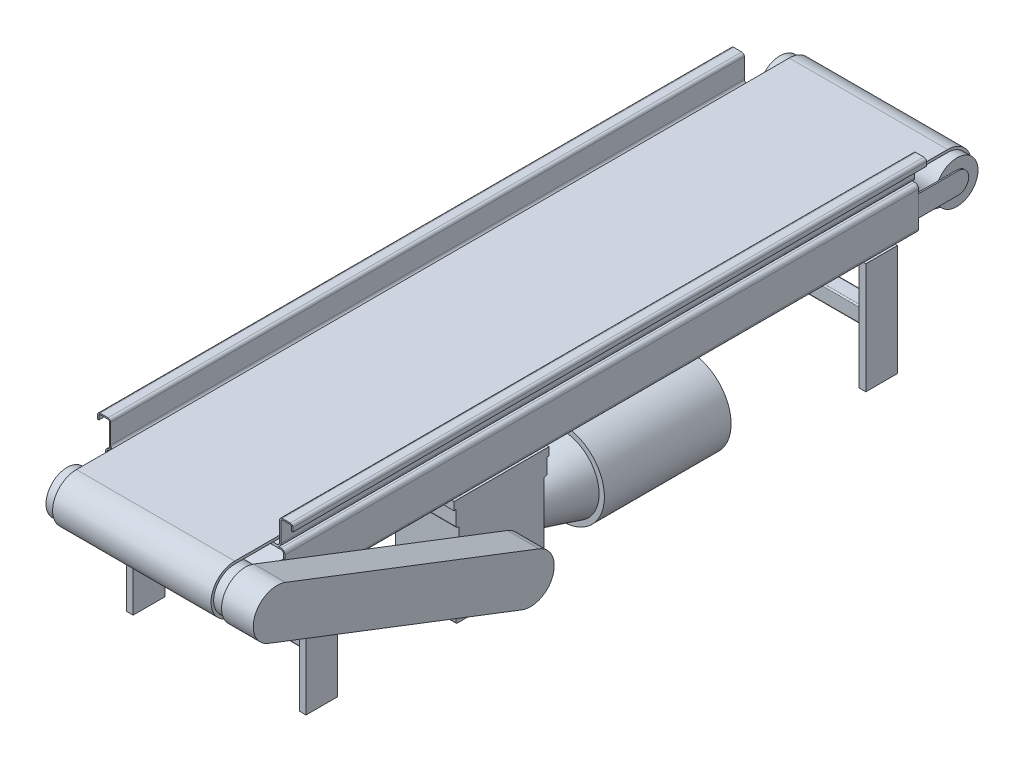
from build123d import *

# Parameters (mm, degrees)
EXTRUDE1_DEPTH   = 762
EXTRUDE2_DEPTH   = 762
SKETCH3_R        = 50.8
SKETCH3_R_2      = 19.05
EXTRUDE3_DEPTH   = 425.45
EXTRUDE4_DEPTH   = 190.5
EXTRUDE5_DEPTH   = 3.175
EXTRUDE5_2_DEPTH = 3.175
EXTRUDE6_DEPTH   = 3.175
EXTRUDE6_2_DEPTH = 3.175
SKETCH7_W        = 228.6
SKETCH7_H        = 19.05
EXTRUDE7_DEPTH   = 152.4
EXTRUDE8_DEPTH   = 152.4
EXTRUDE9_DEPTH   = 76.2
SHELL1_T         = -3.175
SKETCH12_W       = 15.875
SKETCH12_H       = 76.2
EXTRUDE10_DEPTH  = 266.7
EXTRUDE11_DEPTH  = 400.05


with BuildPart() as part:
    # Sketch1 → Extrude1 (new, symmetric)
    with BuildSketch(Plane.XY):
        with BuildLine():
            Line((196.85, 0), (-196.85, 0))
            ThreePointArc((-196.85, 0), (-201.340128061, 1.859871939), (-203.2, 6.35))
            Line((-203.2, 6.35), (-203.2, 53.975))
            ThreePointArc((-203.2, 53.975), (-205.059871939, 58.465128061), (-209.55, 60.325))
            Line((-209.55, 60.325), (-228.6, 60.325))
            ThreePointArc((-228.6, 60.325), (-233.090128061, 58.465128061), (-234.95, 53.975))
            Line((-234.95, 53.975), (-234.95, 44.45))
            Line((-234.95, 44.45), (-231.775, 44.45))
            Line((-231.775, 44.45), (-231.775, 53.975))
            ThreePointArc((-231.775, 53.975), (-230.84506403, 56.22006403), (-228.6, 57.15))
            Line((-228.6, 57.15), (-209.55, 57.15))
            ThreePointArc((-209.55, 57.15), (-207.30493597, 56.22006403), (-206.375, 53.975))
            Line((-206.375, 53.975), (-206.375, 6.35))
            ThreePointArc((-206.375, 6.35), (-203.585192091, -0.385192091), (-196.85, -3.175))
            Line((-196.85, -3.175), (196.85, -3.175))
            ThreePointArc((196.85, -3.175), (203.585192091, -0.385192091), (206.375, 6.35))
            Line((206.375, 6.35), (206.375, 53.975))
            ThreePointArc((206.375, 53.975), (207.30493597, 56.22006403), (209.55, 57.15))
            Line((209.55, 57.15), (228.6, 57.15))
            ThreePointArc((228.6, 57.15), (230.84506403, 56.22006403), (231.775, 53.975))
            Line((231.775, 53.975), (231.775, 44.45))
            Line((231.775, 44.45), (234.95, 44.45))
            Line((234.95, 44.45), (234.95, 53.975))
            ThreePointArc((234.95, 53.975), (233.090128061, 58.465128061), (228.6, 60.325))
            Line((228.6, 60.325), (209.55, 60.325))
            ThreePointArc((209.55, 60.325), (205.059871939, 58.465128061), (203.2, 53.975))
            Line((203.2, 53.975), (203.2, 6.35))
            ThreePointArc((203.2, 6.35), (201.340128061, 1.859871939), (196.85, 0))
        make_face()
    extrude(amount=EXTRUDE1_DEPTH, both=True)

    # Sketch2 → Extrude2 (add, symmetric)
    with BuildSketch(Plane.XY):
        with BuildLine():
            Line((-206.375, -3.175), (-184.15, -3.175))
            Line((-184.15, -3.175), (-184.15, -6.35))
            Line((-184.15, -6.35), (-206.375, -6.35))
            ThreePointArc((-206.375, -6.35), (-210.865128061, -8.209871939), (-212.725, -12.7))
            Line((-212.725, -12.7), (-212.725, -95.25))
            ThreePointArc((-212.725, -95.25), (-210.865128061, -99.740128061), (-206.375, -101.6))
            Line((-206.375, -101.6), (-184.15, -101.6))
            Line((-184.15, -101.6), (-184.15, -104.775))
            Line((-184.15, -104.775), (-206.375, -104.775))
            ThreePointArc((-206.375, -104.775), (-213.110192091, -101.985192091), (-215.9, -95.25))
            Line((-215.9, -95.25), (-215.9, -12.7))
            ThreePointArc((-215.9, -12.7), (-213.110192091, -5.964807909), (-206.375, -3.175))
        make_face()
        with BuildLine():
            Line((206.375, -6.35), (184.15, -6.35))
            Line((184.15, -6.35), (184.15, -3.175))
            Line((184.15, -3.175), (206.375, -3.175))
            ThreePointArc((206.375, -3.175), (213.110192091, -5.964807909), (215.9, -12.7))
            Line((215.9, -12.7), (215.9, -95.25))
            ThreePointArc((215.9, -95.25), (213.110192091, -101.985192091), (206.375, -104.775))
            Line((206.375, -104.775), (184.15, -104.775))
            Line((184.15, -104.775), (184.15, -101.6))
            Line((184.15, -101.6), (206.375, -101.6))
            ThreePointArc((206.375, -101.6), (210.865128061, -99.740128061), (212.725, -95.25))
            Line((212.725, -95.25), (212.725, -12.7))
            ThreePointArc((212.725, -12.7), (210.865128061, -8.209871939), (206.375, -6.35))
        make_face()
    extrude(amount=EXTRUDE2_DEPTH, both=True)

    # Sketch3 → Extrude3 (add)
    with BuildSketch(Plane.ZY.offset(-212.725)):
        with Locations((857.25, -47.625)):
            Circle(SKETCH3_R)
        with Locations(Location((-857.25, -47.625, 0), (0, 0, 180))):
            Circle(SKETCH3_R)
        with Locations(Location((552.45, -53.975, 0), (0, 0, 180))):
            Circle(SKETCH3_R_2)
        with Locations(Location((-552.45, -53.975, 0), (0, 0, 180))):
            Circle(SKETCH3_R_2)
    extrude(amount=EXTRUDE3_DEPTH)


with BuildPart() as extrude3_piece_1:
    # of the separate pieces the step leaves, piece 1, a body of its own (extrude3_pieces)
    add(part.part.solids().sort_by_distance((228.6, 60.325, -762))[0])


with BuildPart() as extrude3_piece_2:
    # of the separate pieces the step leaves, piece 2, a body of its own (extrude3_pieces)
    add(part.part.solids().sort_by_distance((212.725, -47.625, -908.05))[0])


with BuildPart() as extrude3_piece_3:
    # of the separate pieces the step leaves, piece 3, a body of its own (extrude3_pieces)
    add(part.part.solids().sort_by_distance((212.725, -47.625, 908.05))[0])


with BuildPart() as body_4:
    # Sketch4 → Extrude4 (new, symmetric)
    with BuildSketch(Plane(origin=(0, 0, 0), x_dir=(0, 0, -1), z_dir=(1, 0, 0))):
        with BuildLine():
            Line((844.121282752, -103.246572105), (556.826239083, -35.434475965))
            ThreePointArc((556.826239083, -35.434475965), (554.652897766, -35.052797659), (552.45, -34.925))
            Line((552.45, -34.925), (-552.45, -34.925))
            ThreePointArc((-552.45, -34.925), (-554.652897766, -35.052797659), (-556.826239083, -35.434475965))
            Line((-556.826239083, -35.434475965), (-844.121282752, -103.246572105))
            ThreePointArc((-844.121282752, -103.246572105), (-914.016607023, -54.233693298), (-857.25, 9.525))
            Line((-857.25, 9.525), (857.25, 9.525))
            ThreePointArc((857.25, 9.525), (914.016607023, -54.233693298), (844.121282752, -103.246572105))
        make_face()
        with BuildLine():
            Line((-845.580029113, -97.066397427), (-558.284985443, -29.254301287))
            ThreePointArc((-558.284985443, -29.254301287), (-555.387197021, -28.745396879), (-552.45, -28.575))
            Line((-552.45, -28.575), (552.45, -28.575))
            ThreePointArc((552.45, -28.575), (555.387197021, -28.745396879), (558.284985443, -29.254301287))
            Line((558.284985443, -29.254301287), (845.580029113, -97.066397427))
            ThreePointArc((845.580029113, -97.066397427), (907.709206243, -53.499394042), (857.25, 3.175))
            Line((857.25, 3.175), (-857.25, 3.175))
            ThreePointArc((-857.25, 3.175), (-907.709206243, -53.499394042), (-845.580029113, -97.066397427))
        make_face(mode=Mode.SUBTRACT)
    extrude(amount=EXTRUDE4_DEPTH, both=True)


with BuildPart() as body_5:
    # Sketch5 → Extrude5 (new body)
    with BuildSketch(Plane(origin=(212.725, 0, 0), x_dir=(0, 0, -1), z_dir=(1, 0, 0))):
        with BuildLine():
            Line((-857.25, -22.225), (-762, -22.225))
            Line((-762, -22.225), (-762, -73.025))
            Line((-762, -73.025), (-857.25, -73.025))
            ThreePointArc((-857.25, -73.025), (-882.65, -47.625), (-857.25, -22.225))
        make_face()
    extrude(amount=EXTRUDE5_DEPTH)


with BuildPart() as body_6:
    # Sketch5 → Extrude5 2 (new body)
    with BuildSketch(Plane(origin=(212.725, 0, 0), x_dir=(0, 0, -1), z_dir=(1, 0, 0))):
        with BuildLine():
            Line((762, -73.025), (762, -22.225))
            Line((762, -22.225), (857.25, -22.225))
            ThreePointArc((857.25, -22.225), (882.65, -47.625), (857.25, -73.025))
            Line((857.25, -73.025), (762, -73.025))
        make_face()
    extrude(amount=EXTRUDE5_2_DEPTH)


with BuildPart() as body_7:
    # Sketch6 → Extrude6 (new body)
    with BuildSketch(Plane.ZY.offset(212.725)):
        with BuildLine():
            Line((857.25, -73.025), (762, -73.025))
            Line((762, -73.025), (762, -22.225))
            Line((762, -22.225), (857.25, -22.225))
            ThreePointArc((857.25, -22.225), (882.65, -47.625), (857.25, -73.025))
        make_face()
    extrude(amount=EXTRUDE6_DEPTH)


with BuildPart() as body_8:
    # Sketch6 → Extrude6 2 (new body)
    with BuildSketch(Plane.ZY.offset(212.725)):
        with BuildLine():
            Line((-762, -22.225), (-762, -73.025))
            Line((-762, -73.025), (-857.25, -73.025))
            ThreePointArc((-857.25, -73.025), (-882.65, -47.625), (-857.25, -22.225))
            Line((-857.25, -22.225), (-762, -22.225))
        make_face()
    extrude(amount=EXTRUDE6_2_DEPTH)


with BuildPart() as body_9:
    # Sketch7 → Extrude7 (new body)
    with BuildSketch(Plane(origin=(215.9, 0, 0), x_dir=(0, 0, -1), z_dir=(1, 0, 0))):
        with Locations((-241.3, -114.3)):
            Rectangle(SKETCH7_W, SKETCH7_H)
    extrude(amount=-EXTRUDE7_DEPTH)

    # Sketch8 → Extrude8 (add)
    with BuildSketch(Plane(origin=(215.9, 0, 0), x_dir=(0, 0, -1), z_dir=(1, 0, 0))):
        with BuildLine():
            Line((-350.8375, -123.825), (-131.7625, -123.825))
            Line((-131.7625, -123.825), (-131.7625, -158.75))
            ThreePointArc((-131.7625, -158.75), (-132.69243597, -160.99506403), (-134.9375, -161.925))
            Line((-134.9375, -161.925), (-135.73125, -161.925))
            ThreePointArc((-135.73125, -161.925), (-137.97631403, -162.85493597), (-138.90625, -165.1))
            Line((-138.90625, -165.1), (-138.90625, -336.55))
            ThreePointArc((-138.90625, -336.55), (-137.97631403, -338.79506403), (-135.73125, -339.725))
            Line((-135.73125, -339.725), (-134.9375, -339.725))
            ThreePointArc((-134.9375, -339.725), (-132.69243597, -340.65493597), (-131.7625, -342.9))
            Line((-131.7625, -342.9), (-131.7625, -358.775))
            ThreePointArc((-131.7625, -358.775), (-132.69243597, -361.02006403), (-134.9375, -361.95))
            Line((-134.9375, -361.95), (-347.6625, -361.95))
            ThreePointArc((-347.6625, -361.95), (-349.90756403, -361.02006403), (-350.8375, -358.775))
            Line((-350.8375, -358.775), (-350.8375, -342.9))
            ThreePointArc((-350.8375, -342.9), (-349.90756403, -340.65493597), (-347.6625, -339.725))
            Line((-347.6625, -339.725), (-346.86875, -339.725))
            ThreePointArc((-346.86875, -339.725), (-344.62368597, -338.79506403), (-343.69375, -336.55))
            Line((-343.69375, -336.55), (-343.69375, -165.1))
            ThreePointArc((-343.69375, -165.1), (-344.62368597, -162.85493597), (-346.86875, -161.925))
            Line((-346.86875, -161.925), (-347.6625, -161.925))
            ThreePointArc((-347.6625, -161.925), (-349.90756403, -160.99506403), (-350.8375, -158.75))
            Line((-350.8375, -158.75), (-350.8375, -123.825))
        make_face()
    extrude(amount=-EXTRUDE8_DEPTH)

    # Sketch10 → Revolve1 (revolve)
    with BuildSketch(Plane.ZY.offset(-139.7)):
        Polygon((138.90625, -250.825), (138.90625, -194.040385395), (19.05, -161.925), (19.05, -149.225), (-285.75, -149.225), (-285.75, -250.825), align=None)
    revolve(axis=Axis((139.7, -250.825, 138.90625), (0, 0, -1)))


with BuildPart() as body_10:
    # Sketch11 → Extrude9 (new body)
    with BuildSketch(Plane(origin=(215.9, 0, 0), x_dir=(0, 0, -1), z_dir=(1, 0, 0))):
        with BuildLine():
            Line((-227.097127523, -229.248628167), (-836.697127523, 5.701371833))
            ThreePointArc((-836.697127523, 5.701371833), (-910.576371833, -27.072127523), (-877.802872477, -100.951371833))
            Line((-877.802872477, -100.951371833), (-268.202872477, -335.901371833))
            ThreePointArc((-268.202872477, -335.901371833), (-194.323628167, -303.127872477), (-227.097127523, -229.248628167))
        make_face()
    extrude(amount=EXTRUDE9_DEPTH)

    # Shell1
    shell1_openings = [body_10.faces().sort_by_distance(p)[0] for p in [
        (215.9, -165.1, 552.45),
    ]]
    offset(amount=SHELL1_T, openings=shell1_openings, kind=Kind.INTERSECTION)

    # Sketch12 → Extrude10 (add)
    with BuildSketch(Plane.XZ.offset(104.775)):
        with Locations((-207.9625, 673.1)):
            Rectangle(SKETCH12_W, SKETCH12_H)
        with Locations((207.9625, 673.1)):
            Rectangle(SKETCH12_W, SKETCH12_H)
        with Locations((207.9625, -673.1)):
            Rectangle(SKETCH12_W, SKETCH12_H)
        with Locations((-207.9625, -673.1)):
            Rectangle(SKETCH12_W, SKETCH12_H)
    extrude(amount=EXTRUDE10_DEPTH)


with BuildPart() as extrude10_piece_1:
    # of the separate pieces the step leaves, piece 1, a body of its own (extrude10_pieces)
    add(body_10.part.solids().sort_by_distance((215.9, -229.248628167, 227.097127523))[0])


with BuildPart() as extrude10_piece_2:
    # of the separate pieces the step leaves, piece 2, a body of its own (extrude10_pieces)
    add(body_10.part.solids().sort_by_distance((-215.9, -104.775, 711.2))[0])

    # Sketch13 → Extrude11 (add)
    with BuildSketch(Plane(origin=(-200.025, 0, 0), x_dir=(0, 0, -1), z_dir=(1, 0, 0))):
        with BuildLine():
            Line((-688.975, -219.075), (-657.225, -219.075))
            ThreePointArc((-657.225, -219.075), (-654.97993597, -220.00493597), (-654.05, -222.25))
            Line((-654.05, -222.25), (-654.05, -254))
            ThreePointArc((-654.05, -254), (-654.97993597, -256.24506403), (-657.225, -257.175))
            Line((-657.225, -257.175), (-688.975, -257.175))
            ThreePointArc((-688.975, -257.175), (-691.22006403, -256.24506403), (-692.15, -254))
            Line((-692.15, -254), (-692.15, -222.25))
            ThreePointArc((-692.15, -222.25), (-691.22006403, -220.00493597), (-688.975, -219.075))
        make_face()
        with BuildLine():
            Line((654.05, -222.25), (654.05, -254))
            ThreePointArc((654.05, -254), (654.97993597, -256.24506403), (657.225, -257.175))
            Line((657.225, -257.175), (688.975, -257.175))
            ThreePointArc((688.975, -257.175), (691.22006403, -256.24506403), (692.15, -254))
            Line((692.15, -254), (692.15, -222.25))
            ThreePointArc((692.15, -222.25), (691.22006403, -220.00493597), (688.975, -219.075))
            Line((688.975, -219.075), (657.225, -219.075))
            ThreePointArc((657.225, -219.075), (654.97993597, -220.00493597), (654.05, -222.25))
        make_face()
    extrude(amount=EXTRUDE11_DEPTH)


with BuildPart() as extrude10_piece_3:
    # of the separate pieces the step leaves, piece 3, a body of its own (extrude10_pieces)
    add(body_10.part.solids().sort_by_distance((215.9, -104.775, -711.2))[0])


with BuildPart() as extrude10_piece_4:
    # of the separate pieces the step leaves, piece 4, a body of its own (extrude10_pieces)
    add(body_10.part.solids().sort_by_distance((-215.9, -104.775, -635))[0])


with BuildPart() as extrude11_piece_1:
    # of the separate pieces the step leaves, piece 1, a body of its own (extrude11_pieces)
    add(extrude10_piece_2.part.solids().sort_by_distance((-215.9, -104.775, 711.2))[0])


with BuildPart() as extrude11_piece_2:
    # of the separate pieces the step leaves, piece 2, a body of its own (extrude11_pieces)
    add(extrude10_piece_2.part.solids().sort_by_distance((-200.025, -219.075, -657.225))[0])


solid = Compound([extrude3_piece_1.part, extrude3_piece_2.part, extrude3_piece_3.part, body_4.part, body_5.part, body_6.part, body_7.part, body_8.part, body_9.part, extrude10_piece_1.part, extrude10_piece_3.part, extrude10_piece_4.part, extrude11_piece_1.part, extrude11_piece_2.part])
